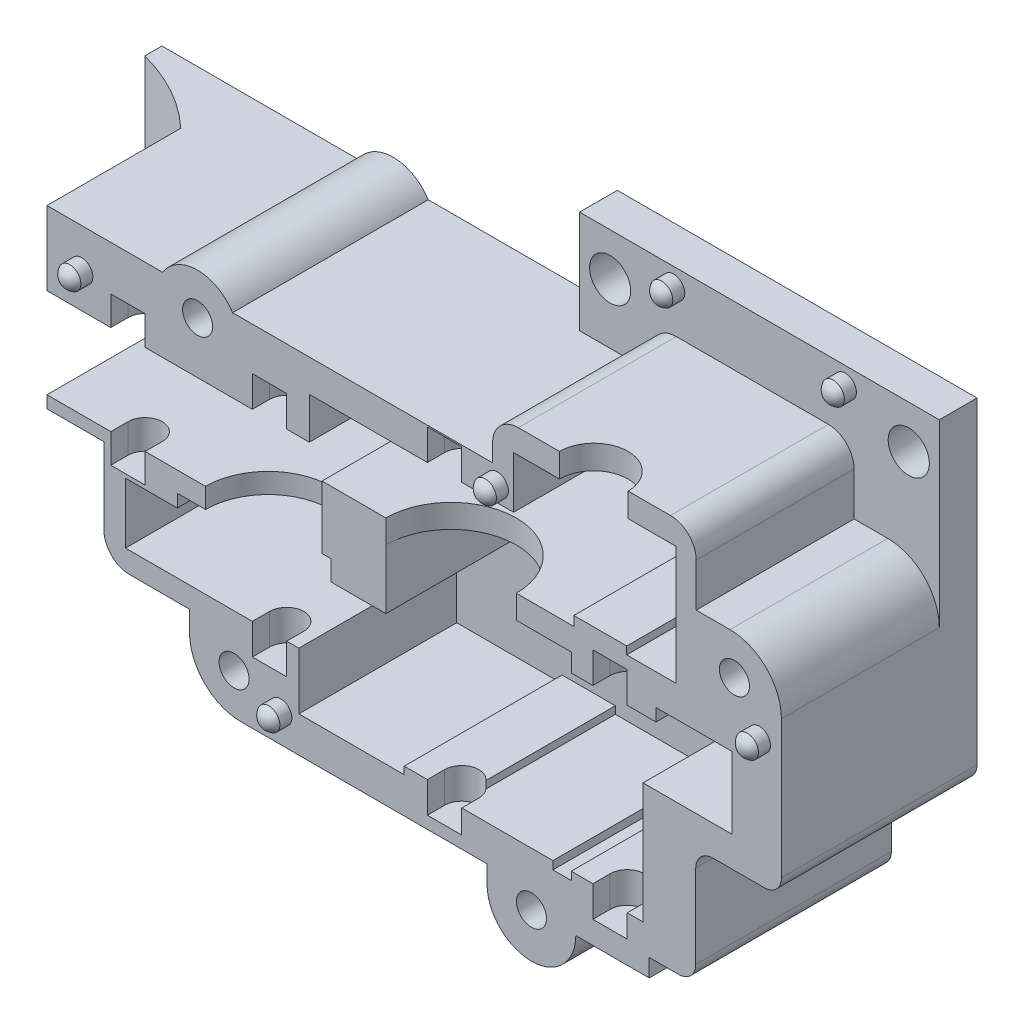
from build123d import *
from build123d.topology import SkipClean

# Parameters (mm, degrees)
ESQUISSE1_R              = 0.875
EXTRUSION1_DEPTH         = 11.4
EXTRUSION2_START         = -2.2
ESQUISSE2_R              = 0.875
ESQUISSE2_R_2            = 1.2
EXTRUSION2_DEPTH         = 2.2
ESQUISSE3_R              = 0.65
EXTRUSION3_DEPTH         = 0.7
D_ME1_FACE_RADIUS        = 0.65
D_ME1_HEIGHT             = 0.4
D_ME2_FACE_RADIUS        = 0.65
D_ME2_HEIGHT             = 0.4
ESQUISSE4_R              = 0.65
EXTRUSION4_DEPTH         = 0.7
D_ME3_FACE_RADIUS        = 0.65
D_ME3_HEIGHT             = 0.4
D_ME4_FACE_RADIUS        = 0.65
D_ME4_HEIGHT             = 0.4
D_ME5_FACE_RADIUS        = 0.65
D_ME5_HEIGHT             = 0.4
D_ME6_FACE_RADIUS        = 0.65
D_ME6_HEIGHT             = 0.4
ESQUISSE5_R              = 3.8
ENL_V_MAT_EXTRU_1_DEPTH  = 1.363330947
ENL_V_MAT_EXTRU_2_DEPTH  = 1.8
ENL_V_MAT_EXTRU_3_DEPTH  = 1.8
ENL_V_MAT_EXTRU_4_DEPTH  = 1.8
ESQUISSE9_R              = 3.65
ENL_V_MAT_EXTRU_5_DEPTH  = 1.17076539
ENL_V_MAT_EXTRU_6_DEPTH  = 1.7
ENL_V_MAT_EXTRU_7_DEPTH  = 47.258189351
EXTRUSION6_DEPTH         = 9.55
EXTRUSION7_REACH         = 49.826
ESQUISSE15_R             = 2
ENL_V_MAT_EXTRU_9_DEPTH  = 51.308687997
ESQUISSE16_R             = 0.65
EXTRUSION8_DEPTH         = 0.7
D_ME7_FACE_RADIUS        = 0.65
D_ME7_HEIGHT             = 0.4
D_ME8_FACE_RADIUS        = 0.65
D_ME8_HEIGHT             = 0.4
ESQUISSE17_R             = 0.75
ENL_V_MAT_EXTRU_10_DEPTH = 54.002827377


with BuildPart() as part:
    # Esquisse1 → Extrusion1 (new body)
    with BuildSketch(Plane.XY):
        with BuildLine():
            Line((-0.746711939, 23.755290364), (5.988887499, 23.755290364))
            ThreePointArc((5.988887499, 23.755290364), (8.030428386, 24.880934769), (10.071969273, 23.755290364))
            Line((10.071969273, 23.755290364), (25.223661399, 23.755290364))
            Line((25.223661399, 23.755290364), (25.223661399, 24.778627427))
            ThreePointArc((25.223661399, 24.778627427), (25.663001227, 25.839287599), (26.723661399, 26.278627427))
            Line((26.723661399, 26.278627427), (35.588714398, 26.278627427))
            ThreePointArc((35.588714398, 26.278627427), (36.649374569, 25.839287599), (37.088714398, 24.778627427))
            Line((37.088714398, 24.778627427), (37.088714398, 22.253474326))
            Line((37.088714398, 22.253474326), (39.053288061, 22.253474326))
            ThreePointArc((39.053288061, 22.253474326), (41.174608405, 21.374794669), (42.053288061, 19.253474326))
            Line((42.053288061, 19.253474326), (42.053288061, 11.227357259))
            ThreePointArc((42.053288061, 11.227357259), (41.760394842, 10.520250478), (41.053288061, 10.227357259))
            Line((41.053288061, 10.227357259), (38.060301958, 10.227357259))
            ThreePointArc((38.060301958, 10.227357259), (37.353195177, 9.934464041), (37.060301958, 9.227357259))
            Line((37.060301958, 9.227357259), (37.060301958, 4.355290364))
            ThreePointArc((37.060301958, 4.355290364), (36.767408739, 3.648183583), (36.060301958, 3.355290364))
            Line((36.060301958, 3.355290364), (34.350625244, 3.355290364))
            Line((34.350625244, 3.355290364), (34.350625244, 2.319451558))
            Line((34.350625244, 2.319451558), (30.070363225, 2.319451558))
            ThreePointArc((30.070363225, 2.319451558), (27.478040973, -0.264975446), (24.901533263, 2.335217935))
            Line((24.901533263, 2.335217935), (24.901533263, 3.355290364))
            Line((24.901533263, 3.355290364), (10.560301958, 3.355290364))
            ThreePointArc((10.560301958, 3.355290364), (8.438981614, 4.233970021), (7.560301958, 6.355290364))
            Line((7.560301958, 6.355290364), (7.560301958, 7.536549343))
            Line((7.560301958, 7.536549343), (4.072236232, 7.536549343))
            ThreePointArc((4.072236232, 7.536549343), (3.01157606, 7.975889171), (2.572236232, 9.036549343))
            Line((2.572236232, 9.036549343), (2.572236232, 13.495919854))
            Line((2.572236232, 13.495919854), (-0.746711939, 13.495919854))
            Line((-0.746711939, 13.495919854), (-0.746711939, 14.205290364))
            Line((-0.746711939, 14.205290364), (15.280772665, 14.205290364))
            Line((15.280772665, 14.205290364), (15.280772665, 17.864035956))
            Line((15.280772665, 17.864035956), (29.958547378, 17.864035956))
            Line((29.958547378, 17.864035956), (29.958547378, 18.420336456))
            Line((29.958547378, 18.420336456), (33.039596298, 18.420336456))
            Line((33.039596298, 18.420336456), (33.039596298, 17.971016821))
            Line((33.039596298, 17.971016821), (35.905578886, 17.971016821))
            Line((35.905578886, 17.971016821), (35.905578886, 24.885063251))
            Line((35.905578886, 24.885063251), (26.449574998, 24.885063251))
            Line((26.449574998, 24.885063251), (26.449574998, 21.871251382))
            Line((26.449574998, 21.871251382), (14.544665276, 21.871251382))
            Line((14.544665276, 21.871251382), (14.544665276, 19.455290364))
            Line((14.544665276, 19.455290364), (-0.746711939, 19.455290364))
            Line((-0.746711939, 19.455290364), (-0.746711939, 23.755290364))
        make_face()
        with Locations((27.485924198, 2.319451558)):
            Circle(ESQUISSE1_R, mode=Mode.SUBTRACT)
        with Locations((39.31495406, 19.957683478)):
            Circle(ESQUISSE1_R, mode=Mode.SUBTRACT)
        with Locations((8.030428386, 22.466777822)):
            Circle(ESQUISSE1_R, mode=Mode.SUBTRACT)
        with Locations((10.159351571, 5.739208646)):
            Circle(ESQUISSE1_R, mode=Mode.SUBTRACT)
        Polygon((6.848526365, 13.034524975), (19.001552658, 13.034524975), (19.001552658, 16.500705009), (29.806620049, 16.500705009), (29.806620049, 15.438883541), (34.749136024, 15.438883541), (34.749136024, 16.166353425), (39.166242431, 16.166353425), (39.166242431, 11.986112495), (33.988368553, 11.986112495), (33.988368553, 4.968167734), (32.939956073, 4.968167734), (32.939956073, 5.438883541), (29.806620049, 5.438883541), (29.806620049, 4.968167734), (28.736811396, 4.968167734), (28.736811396, 5.438883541), (23.175214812, 5.438883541), (23.175214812, 5.871251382), (20.07136131, 5.871251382), (20.07136131, 5.438883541), (13.930659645, 5.438883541), (13.930659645, 8.755290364), (3.831665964, 8.755290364), (3.831665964, 12.285658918), (6.848526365, 12.285658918), align=None, mode=Mode.SUBTRACT)
    extrude(amount=-EXTRUSION1_DEPTH)

    # Esquisse2 → Extrusion2 (add)
    # profile 1 of 3: a face of its own
    with BuildSketch(Plane(origin=(0, 0, -11.4), x_dir=(-1, 0, 0), z_dir=(0, 0, -1)).offset(EXTRUSION2_START)):
        Polygon((5.446711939, 14.205290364), (5.446711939, 23.755290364), (0.746711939, 23.755290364), (0.746711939, 19.455290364), (-14.544665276, 19.455290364), (-14.544665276, 21.871251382), (-26.449574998, 21.871251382), (-26.449574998, 24.885063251), (-35.905578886, 24.885063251), (-35.905578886, 17.971016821), (-33.039596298, 17.971016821), (-33.039596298, 18.420336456), (-29.958547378, 18.420336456), (-29.958547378, 17.864035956), (-15.280772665, 17.864035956), (-15.280772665, 14.205290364), (0.746711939, 14.205290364), align=None)
    # profile 2 of 3: a face of its own
    with BuildSketch(Plane(origin=(0, 0, -11.4), x_dir=(-1, 0, 0), z_dir=(0, 0, -1)).offset(EXTRUSION2_START)):
        with BuildLine():
            Line((0.746711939, 19.455290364), (0.746711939, 23.755290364))
            Line((0.746711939, 23.755290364), (-5.988887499, 23.755290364))
            ThreePointArc((-5.988887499, 23.755290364), (-8.030428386, 24.880934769), (-10.071969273, 23.755290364))
            Line((-10.071969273, 23.755290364), (-21.091249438, 23.755290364))
            Line((-21.091249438, 23.755290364), (-25.223661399, 23.755290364))
            Line((-25.223661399, 23.755290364), (-25.223661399, 24.778627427))
            ThreePointArc((-25.223661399, 24.778627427), (-25.663001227, 25.839287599), (-26.723661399, 26.278627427))
            Line((-26.723661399, 26.278627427), (-35.588714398, 26.278627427))
            ThreePointArc((-35.588714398, 26.278627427), (-36.649374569, 25.839287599), (-37.088714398, 24.778627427))
            Line((-37.088714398, 24.778627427), (-37.088714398, 22.253474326))
            Line((-37.088714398, 22.253474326), (-39.053288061, 22.253474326))
            ThreePointArc((-39.053288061, 22.253474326), (-41.174608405, 21.374794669), (-42.053288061, 19.253474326))
            Line((-42.053288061, 19.253474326), (-42.053288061, 11.227357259))
            ThreePointArc((-42.053288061, 11.227357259), (-41.760394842, 10.520250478), (-41.053288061, 10.227357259))
            Line((-41.053288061, 10.227357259), (-38.060301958, 10.227357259))
            ThreePointArc((-38.060301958, 10.227357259), (-37.353195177, 9.934464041), (-37.060301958, 9.227357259))
            Line((-37.060301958, 9.227357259), (-37.060301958, 4.355290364))
            ThreePointArc((-37.060301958, 4.355290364), (-36.767408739, 3.648183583), (-36.060301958, 3.355290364))
            Line((-36.060301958, 3.355290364), (-34.350625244, 3.355290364))
            Line((-34.350625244, 3.355290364), (-34.350625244, 2.319451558))
            Line((-34.350625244, 2.319451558), (-30.070363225, 2.319451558))
            ThreePointArc((-30.070363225, 2.319451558), (-27.478040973, -0.264975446), (-24.901533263, 2.335217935))
            Line((-24.901533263, 2.335217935), (-24.901533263, 3.355290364))
            Line((-24.901533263, 3.355290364), (-10.560301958, 3.355290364))
            ThreePointArc((-10.560301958, 3.355290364), (-8.438981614, 4.233970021), (-7.560301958, 6.355290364))
            Line((-7.560301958, 6.355290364), (-7.560301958, 7.536549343))
            Line((-7.560301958, 7.536549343), (-4.072236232, 7.536549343))
            ThreePointArc((-4.072236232, 7.536549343), (-3.01157606, 7.975889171), (-2.572236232, 9.036549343))
            Line((-2.572236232, 9.036549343), (-2.572236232, 13.495919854))
            Line((-2.572236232, 13.495919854), (0.746711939, 13.495919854))
            Line((0.746711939, 13.495919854), (0.746711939, 14.205290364))
            Line((0.746711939, 14.205290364), (-15.280772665, 14.205290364))
            Line((-15.280772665, 14.205290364), (-15.280772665, 17.864035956))
            Line((-15.280772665, 17.864035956), (-29.958547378, 17.864035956))
            Line((-29.958547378, 17.864035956), (-29.958547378, 18.420336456))
            Line((-29.958547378, 18.420336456), (-33.039596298, 18.420336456))
            Line((-33.039596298, 18.420336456), (-33.039596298, 17.971016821))
            Line((-33.039596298, 17.971016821), (-35.905578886, 17.971016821))
            Line((-35.905578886, 17.971016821), (-35.905578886, 24.885063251))
            Line((-35.905578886, 24.885063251), (-26.449574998, 24.885063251))
            Line((-26.449574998, 24.885063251), (-26.449574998, 21.871251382))
            Line((-26.449574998, 21.871251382), (-14.544665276, 21.871251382))
            Line((-14.544665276, 21.871251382), (-14.544665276, 19.455290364))
            Line((-14.544665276, 19.455290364), (0.746711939, 19.455290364))
        make_face()
        with Locations(Location((-27.485924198, 2.319451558, 0), (0, 0, 180))):
            Circle(ESQUISSE2_R, mode=Mode.SUBTRACT)
        with Locations(Location((-10.159351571, 5.739208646, 0), (0, 0, 180))):
            Circle(ESQUISSE2_R, mode=Mode.SUBTRACT)
        with Locations(Location((-39.31495406, 19.957683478, 0), (0, 0, 180))):
            Circle(ESQUISSE2_R, mode=Mode.SUBTRACT)
        with Locations(Location((-8.030428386, 22.466777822, 0), (0, 0, 180))):
            Circle(ESQUISSE2_R, mode=Mode.SUBTRACT)
    # profile 3 of 3: a face of its own
    with BuildSketch(Plane(origin=(0, 0, -11.4), x_dir=(-1, 0, 0), z_dir=(0, 0, -1)).offset(EXTRUSION2_START)):
        with BuildLine():
            Line((-25.223661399, 23.755290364), (-21.091249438, 23.755290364))
            Line((-21.091249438, 23.755290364), (-21.091249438, 29.741732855))
            Line((-21.091249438, 29.741732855), (-42.053288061, 29.741732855))
            Line((-42.053288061, 29.741732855), (-42.053288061, 19.253474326))
            ThreePointArc((-42.053288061, 19.253474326), (-41.174608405, 21.374794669), (-39.053288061, 22.253474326))
            Line((-39.053288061, 22.253474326), (-37.088714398, 22.253474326))
            Line((-37.088714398, 22.253474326), (-37.088714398, 24.778627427))
            ThreePointArc((-37.088714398, 24.778627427), (-36.649374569, 25.839287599), (-35.588714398, 26.278627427))
            Line((-35.588714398, 26.278627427), (-26.723661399, 26.278627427))
            ThreePointArc((-26.723661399, 26.278627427), (-25.663001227, 25.839287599), (-25.223661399, 24.778627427))
            Line((-25.223661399, 24.778627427), (-25.223661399, 23.755290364))
        make_face()
        with Locations((-40.27226875, 27.241732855)):
            Circle(ESQUISSE2_R_2, mode=Mode.SUBTRACT)
        with Locations(Location((-22.87226875, 27.241732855, 0), (0, 0, 180))):
            Circle(ESQUISSE2_R_2, mode=Mode.SUBTRACT)
    extrude(amount=EXTRUSION2_DEPTH)

    # Esquisse3 → Extrusion3 (add)
    with BuildSketch(Plane(origin=(0, 0, -9.2), x_dir=(-1, 0, 0), z_dir=(0, 0, -1))):
        with Locations((-36.57226875, 28.706222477)):
            Circle(ESQUISSE3_R)
        with Locations(Location((-26.57226875, 28.706222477, 0), (0, 0, 180))):
            Circle(ESQUISSE3_R)
    extrude(amount=-EXTRUSION3_DEPTH)

    # D_me1: a dome of height H over a round flat face of radius A is a cap of a sphere of radius (A * A + H * H) / (2 * H)
    d_me1_r = (D_ME1_FACE_RADIUS * D_ME1_FACE_RADIUS + D_ME1_HEIGHT * D_ME1_HEIGHT) / (2 * D_ME1_HEIGHT)
    d_me1_base = Plane((36.57226875, 28.706222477, -8.5), z_dir=(0, 0, 1))
    with Locations(d_me1_base.offset(D_ME1_HEIGHT - d_me1_r)):
        d_me1_ball = Sphere(d_me1_r, mode=Mode.PRIVATE)
    add(split(d_me1_ball, bisect_by=d_me1_base, keep=Keep.TOP, mode=Mode.PRIVATE))

    # D_me2: a dome of height H over a round flat face of radius A is a cap of a sphere of radius (A * A + H * H) / (2 * H)
    d_me2_r = (D_ME2_FACE_RADIUS * D_ME2_FACE_RADIUS + D_ME2_HEIGHT * D_ME2_HEIGHT) / (2 * D_ME2_HEIGHT)
    d_me2_base = Plane((26.57226875, 28.706222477, -8.5), z_dir=(0, 0, 1))
    with Locations(d_me2_base.offset(D_ME2_HEIGHT - d_me2_r)):
        d_me2_ball = Sphere(d_me2_r, mode=Mode.PRIVATE)
    add(split(d_me2_ball, bisect_by=d_me2_base, keep=Keep.TOP, mode=Mode.PRIVATE))

    # Esquisse4 → Extrusion4 (add)
    with BuildSketch(Plane.XY):
        with Locations(Location((1.279691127, 21.48502099, 0), (0, 0, 180))):
            Circle(ESQUISSE4_R)
        with Locations(Location((12.877609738, 5.023217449, 0), (0, 0, 180))):
            Circle(ESQUISSE4_R)
        with Locations(Location((40.766008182, 17.584063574, 0), (0, 0, 180))):
            Circle(ESQUISSE4_R)
        with Locations(Location((25.493789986, 22.78547122, 0), (0, 0, 180))):
            Circle(ESQUISSE4_R)
    extrude(amount=EXTRUSION4_DEPTH)

    # D_me3: a dome of height H over a round flat face of radius A is a cap of a sphere of radius (A * A + H * H) / (2 * H)
    d_me3_r = (D_ME3_FACE_RADIUS * D_ME3_FACE_RADIUS + D_ME3_HEIGHT * D_ME3_HEIGHT) / (2 * D_ME3_HEIGHT)
    d_me3_base = Plane((1.279691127, 21.48502099, 0.7), z_dir=(0, 0, 1))
    with Locations(d_me3_base.offset(D_ME3_HEIGHT - d_me3_r)):
        d_me3_ball = Sphere(d_me3_r, mode=Mode.PRIVATE)
    add(split(d_me3_ball, bisect_by=d_me3_base, keep=Keep.TOP, mode=Mode.PRIVATE))

    # D_me4: a dome of height H over a round flat face of radius A is a cap of a sphere of radius (A * A + H * H) / (2 * H)
    d_me4_r = (D_ME4_FACE_RADIUS * D_ME4_FACE_RADIUS + D_ME4_HEIGHT * D_ME4_HEIGHT) / (2 * D_ME4_HEIGHT)
    d_me4_base = Plane((25.493789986, 22.78547122, 0.7), z_dir=(0, 0, 1))
    with Locations(d_me4_base.offset(D_ME4_HEIGHT - d_me4_r)):
        d_me4_ball = Sphere(d_me4_r, mode=Mode.PRIVATE)
    add(split(d_me4_ball, bisect_by=d_me4_base, keep=Keep.TOP, mode=Mode.PRIVATE))

    # D_me5: a dome of height H over a round flat face of radius A is a cap of a sphere of radius (A * A + H * H) / (2 * H)
    d_me5_r = (D_ME5_FACE_RADIUS * D_ME5_FACE_RADIUS + D_ME5_HEIGHT * D_ME5_HEIGHT) / (2 * D_ME5_HEIGHT)
    d_me5_base = Plane((40.766008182, 17.584063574, 0.7), z_dir=(0, 0, 1))
    with Locations(d_me5_base.offset(D_ME5_HEIGHT - d_me5_r)):
        d_me5_ball = Sphere(d_me5_r, mode=Mode.PRIVATE)
    add(split(d_me5_ball, bisect_by=d_me5_base, keep=Keep.TOP, mode=Mode.PRIVATE))

    # D_me6: a dome of height H over a round flat face of radius A is a cap of a sphere of radius (A * A + H * H) / (2 * H)
    d_me6_r = (D_ME6_FACE_RADIUS * D_ME6_FACE_RADIUS + D_ME6_HEIGHT * D_ME6_HEIGHT) / (2 * D_ME6_HEIGHT)
    d_me6_base = Plane((12.877609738, 5.023217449, 0.7), z_dir=(0, 0, 1))
    with Locations(d_me6_base.offset(D_ME6_HEIGHT - d_me6_r)):
        d_me6_ball = Sphere(d_me6_r, mode=Mode.PRIVATE)
    add(split(d_me6_ball, bisect_by=d_me6_base, keep=Keep.TOP, mode=Mode.PRIVATE))

    # Esquisse5 → Enl_v. mat.-Extru.1 (cut)
    with BuildSketch(Plane.XZ.offset(-16.500705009)):
        with Locations((22.801552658, 0)):
            Circle(ESQUISSE5_R)
    extrude(amount=-ENL_V_MAT_EXTRU_1_DEPTH, mode=Mode.SUBTRACT)

    # Esquisse6 → Enl_v. mat.-Extru.2 (cut)
    with BuildSketch(Plane.XZ.offset(-15.438883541)):
        with BuildLine():
            Line((33.067123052, -1), (33.067123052, 0))
            Line((33.067123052, 0), (31.067123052, 0))
            Line((31.067123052, 0), (31.067123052, -1))
            ThreePointArc((31.067123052, -1), (32.067123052, -2), (33.067123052, -1))
        make_face()
    enl_v_mat_extru_2 = extrude(amount=-ENL_V_MAT_EXTRU_2_DEPTH, mode=Mode.SUBTRACT)

    # Sym_trie1: Enl_v. mat.-Extru.2 across plane
    add(enl_v_mat_extru_2.mirror(Plane(origin=(0, 10.438883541, 0), x_dir=(0, 0, 1), z_dir=(0, -1, 0))), mode=Mode.SUBTRACT)

    # Esquisse7 → Enl_v. mat.-Extru.3 (cut)
    with BuildSketch(Plane(origin=(0, 5.871251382, 0), x_dir=(-1, 0, 0), z_dir=(0, 1, 0))):
        with BuildLine():
            Line((-23.424268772, -1), (-23.424268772, 0))
            Line((-23.424268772, 0), (-21.424268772, 0))
            Line((-21.424268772, 0), (-21.424268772, -1))
            ThreePointArc((-21.424268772, -1), (-22.424268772, -2), (-23.424268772, -1))
        make_face()
    enl_v_mat_extru_3 = extrude(amount=-ENL_V_MAT_EXTRU_3_DEPTH, mode=Mode.SUBTRACT)

    # Sym_trie2: Enl_v. mat.-Extru.3 across plane
    add(enl_v_mat_extru_3.mirror(Plane(origin=(0, 13.871251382, 0), x_dir=(0, 0, 1), z_dir=(0, -1, 0))), mode=Mode.SUBTRACT)

    # Esquisse8 → Enl_v. mat.-Extru.4 (cut)
    with BuildSketch(Plane.XZ.offset(-19.455290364)):
        with BuildLine():
            Line((13.22316589, -1), (13.22316589, 0))
            Line((13.22316589, 0), (11.22316589, 0))
            Line((11.22316589, 0), (11.22316589, -1))
            ThreePointArc((11.22316589, -1), (12.22316589, -2), (13.22316589, -1))
        make_face()
    enl_v_mat_extru_4 = extrude(amount=-ENL_V_MAT_EXTRU_4_DEPTH, mode=Mode.SUBTRACT)

    # Sym_trie3: Enl_v. mat.-Extru.4 across plane
    add(enl_v_mat_extru_4.mirror(Plane(origin=(0, 14.105290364, 0), x_dir=(0, 0, 1), z_dir=(0, -1, 0))), mode=Mode.SUBTRACT)

    # Esquisse9 → Enl_v. mat.-Extru.5 (cut)
    with BuildSketch(Plane.XZ.offset(-13.034524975)):
        with Locations((12.143847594, 0)):
            Circle(ESQUISSE9_R)
    extrude(amount=-ENL_V_MAT_EXTRU_5_DEPTH, mode=Mode.SUBTRACT)

    # Esquisse10 → Enl_v. mat.-Extru.6 (cut)
    with BuildSketch(Plane.XZ.offset(-19.455290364)):
        with BuildLine():
            Line((4.97316589, -1), (4.97316589, 0))
            Line((4.97316589, 0), (2.97316589, 0))
            Line((2.97316589, 0), (2.97316589, -1))
            ThreePointArc((2.97316589, -1), (3.97316589, -2), (4.97316589, -1))
        make_face()
    enl_v_mat_extru_6 = extrude(amount=-ENL_V_MAT_EXTRU_6_DEPTH, mode=Mode.SUBTRACT)

    # Sym_trie4: Enl_v. mat.-Extru.6 across plane
    add(enl_v_mat_extru_6.mirror(Plane(origin=(0, 16.831831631, 0), x_dir=(0, 0, 1), z_dir=(0, -1, 0))), mode=Mode.SUBTRACT)

    # Esquisse11 → Enl_v. mat.-Extru.7 (cut, through all)
    with BuildSketch(Plane.XZ.offset(-14.205290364)):
        with BuildLine():
            Line((-0.746711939, -7.8), (-0.746711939, 8.000058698))
            ThreePointArc((-0.746711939, 8.000058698), (-19.037578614, 0.100029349), (-0.746711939, -7.8))
        make_face()
    extrude(amount=-ENL_V_MAT_EXTRU_7_DEPTH, mode=Mode.SUBTRACT)

    # Esquisse14 → Extrusion7 (add, up to next)
    with BuildSketch(Plane.XZ.offset(-19.455290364), mode=Mode.PRIVATE) as extrusion7_sk1:
        Polygon((-0.746711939, -7.8), (6.046846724, -11.4), (-0.746711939, -11.4), align=None)
    extrusion7_tool1 = extrude(extrusion7_sk1.sketch, amount=EXTRUSION7_REACH, mode=Mode.PRIVATE) - part.part


with BuildPart() as body_2:
    # Esquisse12 → Extrusion6 (new body)
    with BuildSketch(Plane.XZ.offset(-14.205290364)):
        with BuildLine():
            Line((-3.152150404, -9.513204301), (-0.746711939, -9.513204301))
            Line((-0.746711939, -9.513204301), (-0.746711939, -7.8))
            ThreePointArc((-0.746711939, -7.8), (-1.890879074, -8.7388127), (-3.152150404, -9.513204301))
        make_face()
    extrude(amount=-EXTRUSION6_DEPTH)


with BuildPart() as part_1:
    add(part.part)

    add(body_2.part)  # Extrusion7 merges body 2
    add(extrusion7_tool1.solids().sort_by_distance((1.517808, 19.45529, -10.2))[0])

    # Esquisse15 → Enl_v. mat.-Extru.9 (cut, through all)
    with SkipClean():  # the faces are left unmerged after this step: merging them gives an invalid solid
        with BuildSketch(Plane.XZ.offset(-24.885063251)):
            with Locations((31.118540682, 0)):
                Circle(ESQUISSE15_R)
        extrude(amount=-ENL_V_MAT_EXTRU_9_DEPTH, mode=Mode.SUBTRACT)

    # Esquisse16 → Extrusion8 (add)
    with SkipClean():  # the faces are left unmerged after this step: merging them gives an invalid solid
        with BuildSketch(Plane.XY.offset(-11.4)):
            with Locations((7.503288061, 17.930443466)):
                Circle(ESQUISSE16_R)
            with Locations((28.503288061, 14.891732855)):
                Circle(ESQUISSE16_R)
        extrude(amount=-EXTRUSION8_DEPTH)

    # D_me7: a dome of height H over a round flat face of radius A is a cap of a sphere of radius (A * A + H * H) / (2 * H)
    d_me7_r = (D_ME7_FACE_RADIUS * D_ME7_FACE_RADIUS + D_ME7_HEIGHT * D_ME7_HEIGHT) / (2 * D_ME7_HEIGHT)
    d_me7_base = Plane((28.503288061, 14.891732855, -12.1), z_dir=(0, 0, -1))
    with Locations(d_me7_base.offset(D_ME7_HEIGHT - d_me7_r)):
        d_me7_ball = Sphere(d_me7_r, mode=Mode.PRIVATE)
    add(split(d_me7_ball, bisect_by=d_me7_base, keep=Keep.TOP, mode=Mode.PRIVATE))

    # D_me8: a dome of height H over a round flat face of radius A is a cap of a sphere of radius (A * A + H * H) / (2 * H)
    d_me8_r = (D_ME8_FACE_RADIUS * D_ME8_FACE_RADIUS + D_ME8_HEIGHT * D_ME8_HEIGHT) / (2 * D_ME8_HEIGHT)
    d_me8_base = Plane((7.503288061, 17.930443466, -12.1), z_dir=(0, 0, -1))
    with Locations(d_me8_base.offset(D_ME8_HEIGHT - d_me8_r)):
        d_me8_ball = Sphere(d_me8_r, mode=Mode.PRIVATE)
    add(split(d_me8_ball, bisect_by=d_me8_base, keep=Keep.TOP, mode=Mode.PRIVATE))

    # Esquisse17 → Enl_v. mat.-Extru.10 (cut, through all)
    with SkipClean():  # the faces are left unmerged after this step: merging them gives an invalid solid
        with BuildSketch(Plane(origin=(0, 0, -11.4), x_dir=(-1, 0, 0), z_dir=(0, 0, -1))):
            with Locations((1.259452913, 18.898202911)):
                Circle(ESQUISSE17_R)
        extrude(amount=-ENL_V_MAT_EXTRU_10_DEPTH, mode=Mode.SUBTRACT)


solid = part_1.part
